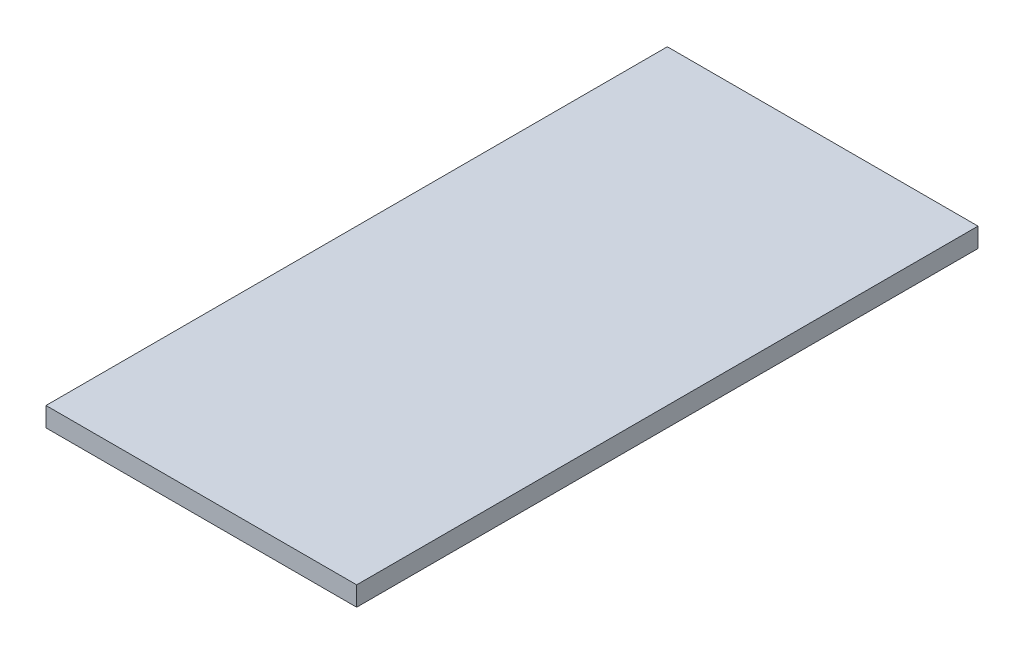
from build123d import *

# Parameters (mm, degrees)
SKETCH1_W      = 304.8
SKETCH1_H      = 19.05
EXTRUDE1_DEPTH = 609.6


with BuildPart() as part:
    # Sketch1 → Extrude1 (new body)
    with BuildSketch(Plane.XY):
        with Locations((152.4, 9.525)):
            Rectangle(SKETCH1_W, SKETCH1_H)
    extrude(amount=EXTRUDE1_DEPTH)


solid = part.part
